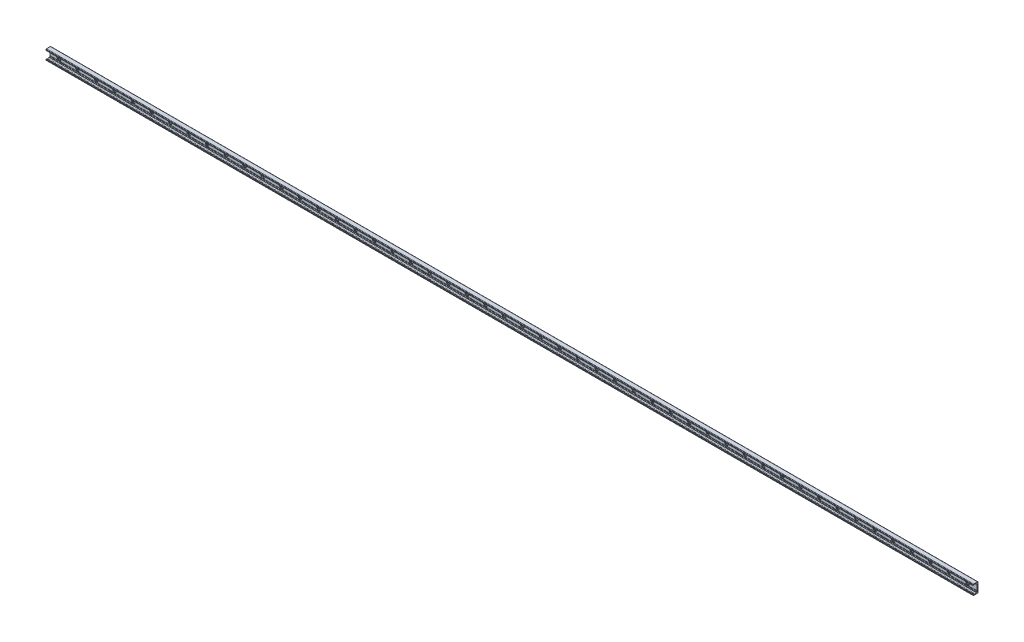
from build123d import *

# Parameters (mm, degrees)
BOSS_EXTRUDE1_DEPTH = 2000
SKETCH2_R           = 9
SKETCH2_R_2         = 4.5
CUT_EXTRUDE1_DEPTH  = 3.1
SKETCH2_2_R         = 4.5
CUT_EXTRUDE2_DEPTH  = 2001.183616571
LPATTERN1_COUNT     = 50
LPATTERN1_PITCH     = 80


with BuildPart() as part:
    # Sketch1 → Boss-Extrude1 (new, symmetric)
    with BuildSketch(Plane(origin=(0, 0, 0), x_dir=(0, 0, -1), z_dir=(1, 0, 0))):
        with BuildLine():
            Line((0, 0), (0, 19))
            ThreePointArc((0, 19), (-0.732233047, 20.767766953), (-2.5, 21.5))
            Line((-2.5, 21.5), (-19, 21.5))
            ThreePointArc((-19, 21.5), (-20.414213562, 20.914213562), (-21, 19.5))
            Line((-21, 19.5), (-21, 16.625057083))
            ThreePointArc((-21, 16.625057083), (-20.553251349, 15.888838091), (-19.693931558, 15.945160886))
            Line((-19.693931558, 15.945160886), (-16.794305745, 17.975500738))
            ThreePointArc((-16.794305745, 17.975500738), (-14.5, 18.69889256), (-12.205694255, 17.975500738))
            Line((-12.205694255, 17.975500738), (-8.829831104, 15.611695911))
            ThreePointArc((-8.829831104, 15.611695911), (-8.28408983, 15.342566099), (-7.682678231, 15.25))
            Line((-7.682678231, 15.25), (-6.5, 15.25))
            ThreePointArc((-6.5, 15.25), (-5.085786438, 14.664213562), (-4.5, 13.25))
            Line((-4.5, 13.25), (-4.5, -10.75))
            ThreePointArc((-4.5, -10.75), (-4.25, -11), (-4.5, -11.25))
            Line((-4.5, -11.25), (-4.5, -12.25))
            ThreePointArc((-4.5, -12.25), (-4.25, -12.5), (-4.5, -12.75))
            Line((-4.5, -12.75), (-4.5, -13.25))
            ThreePointArc((-4.5, -13.25), (-5.085786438, -14.664213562), (-6.5, -15.25))
            Line((-6.5, -15.25), (-7.682678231, -15.25))
            ThreePointArc((-7.682678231, -15.25), (-8.28408983, -15.342566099), (-8.829831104, -15.611695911))
            Line((-8.829831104, -15.611695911), (-12.205694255, -17.975500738))
            ThreePointArc((-12.205694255, -17.975500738), (-14.5, -18.69889256), (-16.794305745, -17.975500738))
            Line((-16.794305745, -17.975500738), (-19.693931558, -15.945160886))
            ThreePointArc((-19.693931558, -15.945160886), (-20.553251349, -15.888838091), (-21, -16.625057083))
            Line((-21, -16.625057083), (-21, -19.5))
            ThreePointArc((-21, -19.5), (-20.414213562, -20.914213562), (-19, -21.5))
            Line((-19, -21.5), (-2.5, -21.5))
            ThreePointArc((-2.5, -21.5), (-0.732233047, -20.767766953), (0, -19))
            Line((0, -19), (0, 0))
        make_face()
    extrude(amount=BOSS_EXTRUDE1_DEPTH, both=True)

    # Sketch2 → Cut-Extrude1 (cut)
    with BuildSketch(Plane.XY.offset(4.5)):
        with Locations((1960, 0)):
            Circle(SKETCH2_R)
        with Locations((1960, 0)):
            Circle(SKETCH2_R_2, mode=Mode.SUBTRACT)
    cut_extrude1 = extrude(amount=-CUT_EXTRUDE1_DEPTH, mode=Mode.SUBTRACT)

    # Sketch2_2 → Cut-Extrude2 (cut, through all)
    with BuildSketch(Plane.XY.offset(4.5)):
        with Locations((1960, 0)):
            Circle(SKETCH2_2_R)
    cut_extrude2 = extrude(amount=-CUT_EXTRUDE2_DEPTH, mode=Mode.SUBTRACT)

    # LPattern1: Cut-Extrude1, Cut-Extrude2 ×50
    with Locations(*[(-i * LPATTERN1_PITCH, 0, 0) for i in range(1, LPATTERN1_COUNT)]):
        add(cut_extrude1, mode=Mode.SUBTRACT)
        add(cut_extrude2, mode=Mode.SUBTRACT)


solid = part.part
